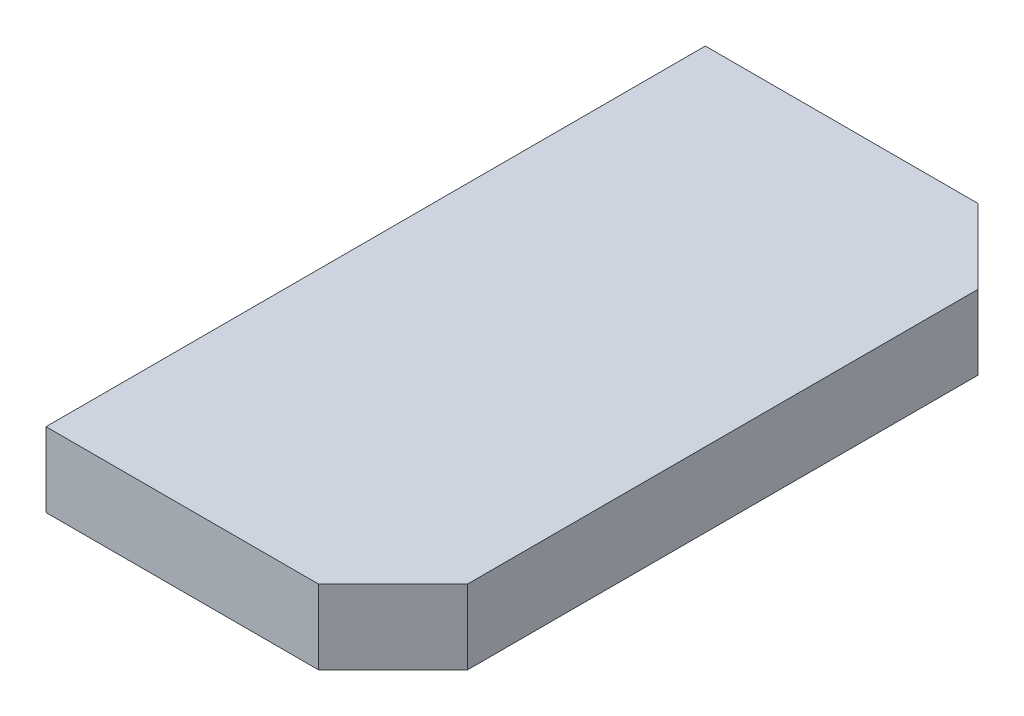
ISO-10303-21;
HEADER;
FILE_DESCRIPTION(('STEP AP214'),'2;1');
FILE_NAME('part.step','',(''),(''),'','','');
FILE_SCHEMA(('AUTOMOTIVE_DESIGN { 1 0 10303 214 1 1 1 1 }'));
ENDSEC;
DATA;
#1=APPLICATION_CONTEXT('core data for automotive mechanical design processes');
#2=APPLICATION_PROTOCOL_DEFINITION('international standard','automotive_design',2000,#1);
#3=PRODUCT_CONTEXT('',#1,'mechanical');
#4=PRODUCT('Part','Part','',(#3));
#5=PRODUCT_RELATED_PRODUCT_CATEGORY('part','',(#4));
#6=PRODUCT_DEFINITION_FORMATION('','',#4);
#7=PRODUCT_DEFINITION_CONTEXT('part definition',#1,'design');
#8=PRODUCT_DEFINITION('design','',#6,#7);
#9=PRODUCT_DEFINITION_SHAPE('','',#8);
#10=(LENGTH_UNIT() NAMED_UNIT(*) SI_UNIT(.MILLI.,.METRE.));
#11=(NAMED_UNIT(*) PLANE_ANGLE_UNIT() SI_UNIT($,.RADIAN.));
#12=(NAMED_UNIT(*) SI_UNIT($,.STERADIAN.) SOLID_ANGLE_UNIT());
#13=UNCERTAINTY_MEASURE_WITH_UNIT(LENGTH_MEASURE(1.E-05),#10,'distance_accuracy_value','');
#14=(GEOMETRIC_REPRESENTATION_CONTEXT(3) GLOBAL_UNCERTAINTY_ASSIGNED_CONTEXT((#13)) GLOBAL_UNIT_ASSIGNED_CONTEXT((#10,
#11,#12)) REPRESENTATION_CONTEXT('',''));
#15=CARTESIAN_POINT('',(0.,0.,0.));
#16=DIRECTION('',(0.,0.,1.));
#17=DIRECTION('',(1.,0.,0.));
#18=AXIS2_PLACEMENT_3D('',#15,#16,#17);
#19=CARTESIAN_POINT('',(0.,0.,133.));
#20=DIRECTION('',(1.,0.,0.));
#21=DIRECTION('',(0.,0.,-1.));
#22=AXIS2_PLACEMENT_3D('',#19,#20,#21);
#23=PLANE('',#22);
#24=DIRECTION('',(0.,-1.,0.));
#25=VECTOR('',#24,1.);
#26=CARTESIAN_POINT('',(0.,0.,0.));
#27=LINE('',#26,#25);
#28=CARTESIAN_POINT('',(0.,15.,0.));
#29=VERTEX_POINT('',#28);
#30=CARTESIAN_POINT('',(0.,0.,0.));
#31=VERTEX_POINT('',#30);
#32=EDGE_CURVE('E88',#29,#31,#27,.T.);
#33=ORIENTED_EDGE('',*,*,#32,.T.);
#34=DIRECTION('',(0.,0.,-1.));
#35=VECTOR('',#34,1.);
#36=CARTESIAN_POINT('',(0.,0.,133.));
#37=LINE('',#36,#35);
#38=CARTESIAN_POINT('',(0.,0.,133.));
#39=VERTEX_POINT('',#38);
#40=EDGE_CURVE('E93',#39,#31,#37,.T.);
#41=ORIENTED_EDGE('',*,*,#40,.F.);
#42=DIRECTION('',(0.,-1.,0.));
#43=VECTOR('',#42,1.);
#44=CARTESIAN_POINT('',(0.,0.,133.));
#45=LINE('',#44,#43);
#46=CARTESIAN_POINT('',(0.,15.,133.));
#47=VERTEX_POINT('',#46);
#48=EDGE_CURVE('E108',#47,#39,#45,.T.);
#49=ORIENTED_EDGE('',*,*,#48,.F.);
#50=DIRECTION('',(0.,0.,-1.));
#51=VECTOR('',#50,1.);
#52=CARTESIAN_POINT('',(0.,15.,133.));
#53=LINE('',#52,#51);
#54=EDGE_CURVE('E104',#47,#29,#53,.T.);
#55=ORIENTED_EDGE('',*,*,#54,.T.);
#56=EDGE_LOOP('',(#33,#41,#49,#55));
#57=FACE_BOUND('',#56,.T.);
#58=ADVANCED_FACE('F32',(#57),#23,.F.);
#59=CARTESIAN_POINT('',(0.,0.,133.));
#60=DIRECTION('',(0.,1.,0.));
#61=DIRECTION('',(0.,0.,1.));
#62=AXIS2_PLACEMENT_3D('',#59,#60,#61);
#63=PLANE('',#62);
#64=DIRECTION('',(1.,0.,0.));
#65=VECTOR('',#64,1.);
#66=CARTESIAN_POINT('',(0.,0.,0.));
#67=LINE('',#66,#65);
#68=CARTESIAN_POINT('',(54.9999999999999,0.,0.));
#69=VERTEX_POINT('',#68);
#70=EDGE_CURVE('E84',#31,#69,#67,.T.);
#71=ORIENTED_EDGE('',*,*,#70,.T.);
#72=DIRECTION('',(0.707106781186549,0.,0.707106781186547));
#73=VECTOR('',#72,1.);
#74=CARTESIAN_POINT('',(70.,0.,15.));
#75=LINE('',#74,#73);
#76=CARTESIAN_POINT('',(70.,0.,15.));
#77=VERTEX_POINT('',#76);
#78=EDGE_CURVE('E39',#69,#77,#75,.T.);
#79=ORIENTED_EDGE('',*,*,#78,.T.);
#80=DIRECTION('',(0.,0.,-1.));
#81=VECTOR('',#80,1.);
#82=CARTESIAN_POINT('',(70.,0.,133.));
#83=LINE('',#82,#81);
#84=CARTESIAN_POINT('',(70.,0.,118.));
#85=VERTEX_POINT('',#84);
#86=EDGE_CURVE('E100',#85,#77,#83,.T.);
#87=ORIENTED_EDGE('',*,*,#86,.F.);
#88=DIRECTION('',(0.707106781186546,0.,-0.707106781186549));
#89=VECTOR('',#88,1.);
#90=CARTESIAN_POINT('',(55.,0.,133.));
#91=LINE('',#90,#89);
#92=CARTESIAN_POINT('',(55.,0.,133.));
#93=VERTEX_POINT('',#92);
#94=EDGE_CURVE('E46',#85,#93,#91,.F.);
#95=ORIENTED_EDGE('',*,*,#94,.T.);
#96=DIRECTION('',(1.,0.,0.));
#97=VECTOR('',#96,1.);
#98=CARTESIAN_POINT('',(0.,0.,133.));
#99=LINE('',#98,#97);
#100=EDGE_CURVE('E95',#39,#93,#99,.T.);
#101=ORIENTED_EDGE('',*,*,#100,.F.);
#102=ORIENTED_EDGE('',*,*,#40,.T.);
#103=EDGE_LOOP('',(#71,#79,#87,#95,#101,#102));
#104=FACE_BOUND('',#103,.T.);
#105=ADVANCED_FACE('F94',(#104),#63,.F.);
#106=CARTESIAN_POINT('',(70.,0.,133.));
#107=DIRECTION('',(-1.,0.,0.));
#108=DIRECTION('',(0.,0.,1.));
#109=AXIS2_PLACEMENT_3D('',#106,#107,#108);
#110=PLANE('',#109);
#111=ORIENTED_EDGE('',*,*,#86,.T.);
#112=DIRECTION('',(0.,1.,0.));
#113=VECTOR('',#112,1.);
#114=CARTESIAN_POINT('',(70.,15.,15.));
#115=LINE('',#114,#113);
#116=CARTESIAN_POINT('',(70.,15.,15.));
#117=VERTEX_POINT('',#116);
#118=EDGE_CURVE('E120',#77,#117,#115,.T.);
#119=ORIENTED_EDGE('',*,*,#118,.T.);
#120=DIRECTION('',(0.,0.,-1.));
#121=VECTOR('',#120,1.);
#122=CARTESIAN_POINT('',(70.,15.,133.));
#123=LINE('',#122,#121);
#124=CARTESIAN_POINT('',(70.,15.,118.));
#125=VERTEX_POINT('',#124);
#126=EDGE_CURVE('E114',#125,#117,#123,.T.);
#127=ORIENTED_EDGE('',*,*,#126,.F.);
#128=DIRECTION('',(0.,-1.,0.));
#129=VECTOR('',#128,1.);
#130=CARTESIAN_POINT('',(70.,0.,118.));
#131=LINE('',#130,#129);
#132=EDGE_CURVE('E99',#125,#85,#131,.T.);
#133=ORIENTED_EDGE('',*,*,#132,.T.);
#134=EDGE_LOOP('',(#111,#119,#127,#133));
#135=FACE_BOUND('',#134,.T.);
#136=ADVANCED_FACE('F131',(#135),#110,.F.);
#137=CARTESIAN_POINT('',(0.,15.,133.));
#138=DIRECTION('',(0.,-1.,0.));
#139=DIRECTION('',(0.,0.,-1.));
#140=AXIS2_PLACEMENT_3D('',#137,#138,#139);
#141=PLANE('',#140);
#142=ORIENTED_EDGE('',*,*,#126,.T.);
#143=DIRECTION('',(-0.707106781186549,0.,-0.707106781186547));
#144=VECTOR('',#143,1.);
#145=CARTESIAN_POINT('',(70.,15.,15.));
#146=LINE('',#145,#144);
#147=CARTESIAN_POINT('',(54.9999999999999,15.,0.));
#148=VERTEX_POINT('',#147);
#149=EDGE_CURVE('E125',#117,#148,#146,.T.);
#150=ORIENTED_EDGE('',*,*,#149,.T.);
#151=DIRECTION('',(-1.,0.,0.));
#152=VECTOR('',#151,1.);
#153=CARTESIAN_POINT('',(0.,15.,0.));
#154=LINE('',#153,#152);
#155=EDGE_CURVE('E90',#148,#29,#154,.T.);
#156=ORIENTED_EDGE('',*,*,#155,.T.);
#157=ORIENTED_EDGE('',*,*,#54,.F.);
#158=DIRECTION('',(-1.,0.,0.));
#159=VECTOR('',#158,1.);
#160=CARTESIAN_POINT('',(0.,15.,133.));
#161=LINE('',#160,#159);
#162=CARTESIAN_POINT('',(55.,15.,133.));
#163=VERTEX_POINT('',#162);
#164=EDGE_CURVE('E111',#163,#47,#161,.T.);
#165=ORIENTED_EDGE('',*,*,#164,.F.);
#166=DIRECTION('',(-0.707106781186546,0.,0.707106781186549));
#167=VECTOR('',#166,1.);
#168=CARTESIAN_POINT('',(55.,15.,133.));
#169=LINE('',#168,#167);
#170=EDGE_CURVE('E123',#163,#125,#169,.F.);
#171=ORIENTED_EDGE('',*,*,#170,.T.);
#172=EDGE_LOOP('',(#142,#150,#156,#157,#165,#171));
#173=FACE_BOUND('',#172,.T.);
#174=ADVANCED_FACE('F136',(#173),#141,.F.);
#175=CARTESIAN_POINT('',(0.,15.,133.));
#176=DIRECTION('',(0.,0.,-1.));
#177=DIRECTION('',(-1.,0.,0.));
#178=AXIS2_PLACEMENT_3D('',#175,#176,#177);
#179=PLANE('',#178);
#180=ORIENTED_EDGE('',*,*,#100,.T.);
#181=DIRECTION('',(0.,1.,0.));
#182=VECTOR('',#181,1.);
#183=CARTESIAN_POINT('',(55.,15.,133.));
#184=LINE('',#183,#182);
#185=EDGE_CURVE('E11',#93,#163,#184,.T.);
#186=ORIENTED_EDGE('',*,*,#185,.T.);
#187=ORIENTED_EDGE('',*,*,#164,.T.);
#188=ORIENTED_EDGE('',*,*,#48,.T.);
#189=EDGE_LOOP('',(#180,#186,#187,#188));
#190=FACE_BOUND('',#189,.T.);
#191=ADVANCED_FACE('F142',(#190),#179,.F.);
#192=CARTESIAN_POINT('',(0.,15.,0.));
#193=DIRECTION('',(0.,0.,-1.));
#194=DIRECTION('',(-1.,0.,0.));
#195=AXIS2_PLACEMENT_3D('',#192,#193,#194);
#196=PLANE('',#195);
#197=ORIENTED_EDGE('',*,*,#155,.F.);
#198=DIRECTION('',(0.,-1.,0.));
#199=VECTOR('',#198,1.);
#200=CARTESIAN_POINT('',(54.9999999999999,0.,0.));
#201=LINE('',#200,#199);
#202=EDGE_CURVE('E54',#148,#69,#201,.T.);
#203=ORIENTED_EDGE('',*,*,#202,.T.);
#204=ORIENTED_EDGE('',*,*,#70,.F.);
#205=ORIENTED_EDGE('',*,*,#32,.F.);
#206=EDGE_LOOP('',(#197,#203,#204,#205));
#207=FACE_BOUND('',#206,.T.);
#208=ADVANCED_FACE('F86',(#207),#196,.T.);
#209=CARTESIAN_POINT('',(70.,0.,15.));
#210=DIRECTION('',(0.707106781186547,0.,-0.707106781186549));
#211=DIRECTION('',(-0.707106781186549,0.,-0.707106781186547));
#212=AXIS2_PLACEMENT_3D('',#209,#210,#211);
#213=PLANE('',#212);
#214=ORIENTED_EDGE('',*,*,#78,.F.);
#215=ORIENTED_EDGE('',*,*,#202,.F.);
#216=ORIENTED_EDGE('',*,*,#149,.F.);
#217=ORIENTED_EDGE('',*,*,#118,.F.);
#218=EDGE_LOOP('',(#214,#215,#216,#217));
#219=FACE_BOUND('',#218,.T.);
#220=ADVANCED_FACE('F134',(#219),#213,.T.);
#221=CARTESIAN_POINT('',(55.,15.,133.));
#222=DIRECTION('',(-0.707106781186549,0.,-0.707106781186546));
#223=DIRECTION('',(-0.707106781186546,0.,0.707106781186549));
#224=AXIS2_PLACEMENT_3D('',#221,#222,#223);
#225=PLANE('',#224);
#226=ORIENTED_EDGE('',*,*,#94,.F.);
#227=ORIENTED_EDGE('',*,*,#132,.F.);
#228=ORIENTED_EDGE('',*,*,#170,.F.);
#229=ORIENTED_EDGE('',*,*,#185,.F.);
#230=EDGE_LOOP('',(#226,#227,#228,#229));
#231=FACE_BOUND('',#230,.T.);
#232=ADVANCED_FACE('F139',(#231),#225,.F.);
#233=CLOSED_SHELL('',(#58,#105,#136,#174,#191,#208,#220,#232));
#234=MANIFOLD_SOLID_BREP('B2',#233);
#235=ADVANCED_BREP_SHAPE_REPRESENTATION('',(#18,#234),#14);
#236=SHAPE_DEFINITION_REPRESENTATION(#9,#235);
ENDSEC;
END-ISO-10303-21;
